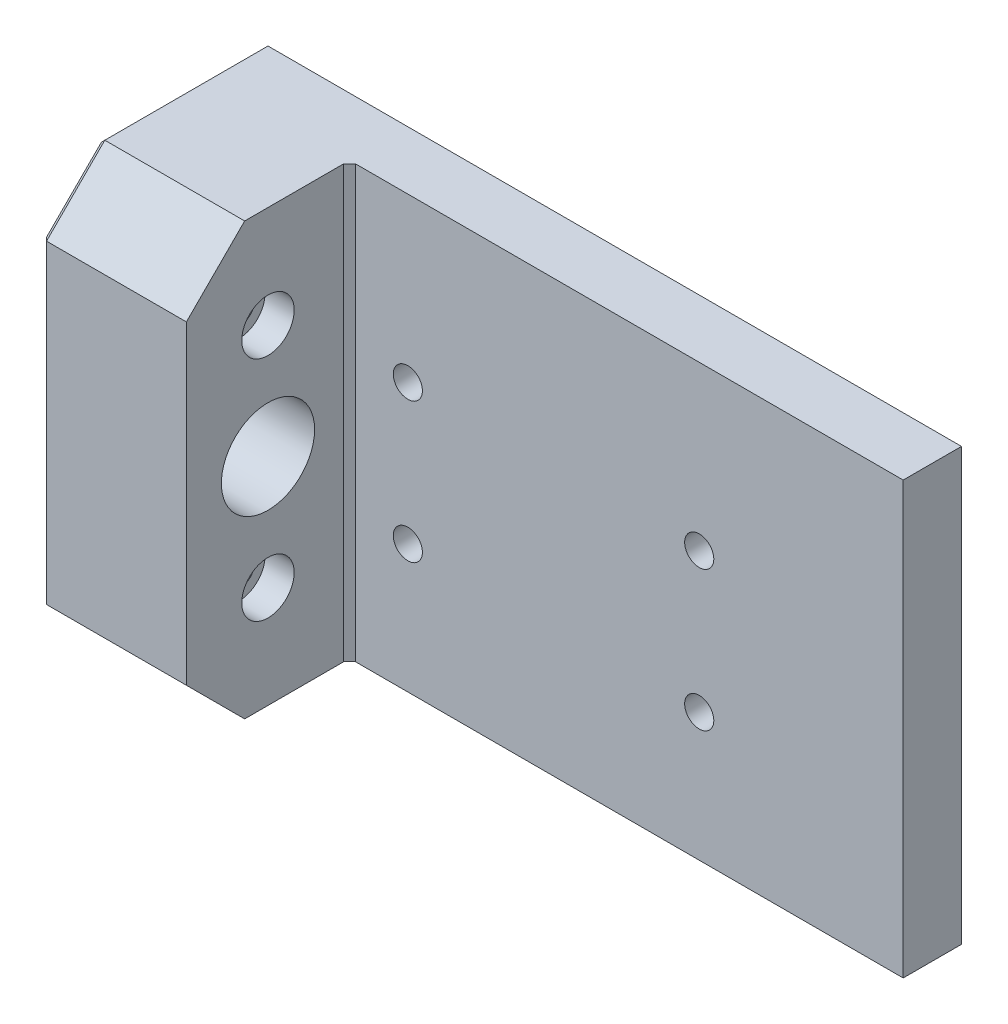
ISO-10303-21;
HEADER;
FILE_DESCRIPTION(('STEP AP214'),'2;1');
FILE_NAME('part.step','',(''),(''),'','','');
FILE_SCHEMA(('AUTOMOTIVE_DESIGN { 1 0 10303 214 1 1 1 1 }'));
ENDSEC;
DATA;
#1=APPLICATION_CONTEXT('core data for automotive mechanical design processes');
#2=APPLICATION_PROTOCOL_DEFINITION('international standard','automotive_design',2000,#1);
#3=PRODUCT_CONTEXT('',#1,'mechanical');
#4=PRODUCT('Part','Part','',(#3));
#5=PRODUCT_RELATED_PRODUCT_CATEGORY('part','',(#4));
#6=PRODUCT_DEFINITION_FORMATION('','',#4);
#7=PRODUCT_DEFINITION_CONTEXT('part definition',#1,'design');
#8=PRODUCT_DEFINITION('design','',#6,#7);
#9=PRODUCT_DEFINITION_SHAPE('','',#8);
#10=(LENGTH_UNIT() NAMED_UNIT(*) SI_UNIT(.MILLI.,.METRE.));
#11=(NAMED_UNIT(*) PLANE_ANGLE_UNIT() SI_UNIT($,.RADIAN.));
#12=(NAMED_UNIT(*) SI_UNIT($,.STERADIAN.) SOLID_ANGLE_UNIT());
#13=UNCERTAINTY_MEASURE_WITH_UNIT(LENGTH_MEASURE(1.E-05),#10,'distance_accuracy_value','');
#14=(GEOMETRIC_REPRESENTATION_CONTEXT(3) GLOBAL_UNCERTAINTY_ASSIGNED_CONTEXT((#13)) GLOBAL_UNIT_ASSIGNED_CONTEXT((#10,
#11,#12)) REPRESENTATION_CONTEXT('',''));
#15=CARTESIAN_POINT('',(0.,0.,0.));
#16=DIRECTION('',(0.,0.,1.));
#17=DIRECTION('',(1.,0.,0.));
#18=AXIS2_PLACEMENT_3D('',#15,#16,#17);
#19=CARTESIAN_POINT('',(60.0000000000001,17.5,4.99999999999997));
#20=DIRECTION('',(-1.,0.,0.));
#21=DIRECTION('',(0.,0.,1.));
#22=AXIS2_PLACEMENT_3D('',#19,#20,#21);
#23=CYLINDRICAL_SURFACE('',#22,2.75);
#24=CARTESIAN_POINT('',(-50.,17.5,5.00000000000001));
#25=DIRECTION('',(-1.,0.,0.));
#26=DIRECTION('',(0.,0.,1.));
#27=AXIS2_PLACEMENT_3D('',#24,#25,#26);
#28=CIRCLE('',#27,2.75);
#29=CARTESIAN_POINT('',(-50.,17.5,7.75000000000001));
#30=VERTEX_POINT('',#29);
#31=EDGE_CURVE('E20',#30,#30,#28,.F.);
#32=ORIENTED_EDGE('',*,*,#31,.F.);
#33=EDGE_LOOP('',(#32));
#34=FACE_BOUND('',#33,.T.);
#35=CARTESIAN_POINT('',(-39.9999999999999,17.5,5.00000000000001));
#36=DIRECTION('',(-1.,0.,0.));
#37=DIRECTION('',(0.,0.,1.));
#38=AXIS2_PLACEMENT_3D('',#35,#36,#37);
#39=CIRCLE('',#38,2.75);
#40=CARTESIAN_POINT('',(-39.9999999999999,17.5,7.75000000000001));
#41=VERTEX_POINT('',#40);
#42=EDGE_CURVE('E212',#41,#41,#39,.T.);
#43=ORIENTED_EDGE('',*,*,#42,.F.);
#44=EDGE_LOOP('',(#43));
#45=FACE_BOUND('',#44,.T.);
#46=ADVANCED_FACE('F17',(#34,#45),#23,.F.);
#47=CARTESIAN_POINT('',(60.0000000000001,56.5,4.99999999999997));
#48=DIRECTION('',(-1.,0.,0.));
#49=DIRECTION('',(0.,0.,1.));
#50=AXIS2_PLACEMENT_3D('',#47,#48,#49);
#51=CYLINDRICAL_SURFACE('',#50,2.75);
#52=CARTESIAN_POINT('',(-50.,56.5,5.00000000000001));
#53=DIRECTION('',(-1.,0.,0.));
#54=DIRECTION('',(0.,0.,1.));
#55=AXIS2_PLACEMENT_3D('',#52,#53,#54);
#56=CIRCLE('',#55,2.75);
#57=CARTESIAN_POINT('',(-50.,56.5,7.75000000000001));
#58=VERTEX_POINT('',#57);
#59=EDGE_CURVE('E214',#58,#58,#56,.F.);
#60=ORIENTED_EDGE('',*,*,#59,.F.);
#61=EDGE_LOOP('',(#60));
#62=FACE_BOUND('',#61,.T.);
#63=CARTESIAN_POINT('',(-39.9999999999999,56.5,5.00000000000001));
#64=DIRECTION('',(-1.,0.,0.));
#65=DIRECTION('',(0.,0.,1.));
#66=AXIS2_PLACEMENT_3D('',#63,#64,#65);
#67=CIRCLE('',#66,2.75);
#68=CARTESIAN_POINT('',(-39.9999999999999,56.5,7.75000000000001));
#69=VERTEX_POINT('',#68);
#70=EDGE_CURVE('E117',#69,#69,#67,.T.);
#71=ORIENTED_EDGE('',*,*,#70,.F.);
#72=EDGE_LOOP('',(#71));
#73=FACE_BOUND('',#72,.T.);
#74=ADVANCED_FACE('F225',(#62,#73),#51,.F.);
#75=CARTESIAN_POINT('',(-50.,17.5,5.00000000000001));
#76=DIRECTION('',(-1.,0.,0.));
#77=DIRECTION('',(0.,0.,1.));
#78=AXIS2_PLACEMENT_3D('',#75,#76,#77);
#79=PLANE('',#78);
#80=CARTESIAN_POINT('',(-50.,17.5,5.00000000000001));
#81=DIRECTION('',(-1.,0.,0.));
#82=DIRECTION('',(0.,0.,1.));
#83=AXIS2_PLACEMENT_3D('',#80,#81,#82);
#84=CIRCLE('',#83,6.);
#85=CARTESIAN_POINT('',(-50.,17.5,11.));
#86=VERTEX_POINT('',#85);
#87=EDGE_CURVE('E116',#86,#86,#84,.T.);
#88=ORIENTED_EDGE('',*,*,#87,.T.);
#89=EDGE_LOOP('',(#88));
#90=FACE_BOUND('',#89,.T.);
#91=ORIENTED_EDGE('',*,*,#31,.T.);
#92=EDGE_LOOP('',(#91));
#93=FACE_BOUND('',#92,.T.);
#94=ADVANCED_FACE('F221',(#90,#93),#79,.T.);
#95=CARTESIAN_POINT('',(-50.,56.5,5.00000000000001));
#96=DIRECTION('',(-1.,0.,0.));
#97=DIRECTION('',(0.,0.,1.));
#98=AXIS2_PLACEMENT_3D('',#95,#96,#97);
#99=PLANE('',#98);
#100=CARTESIAN_POINT('',(-50.,56.5,5.00000000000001));
#101=DIRECTION('',(-1.,0.,0.));
#102=DIRECTION('',(0.,0.,1.));
#103=AXIS2_PLACEMENT_3D('',#100,#101,#102);
#104=CIRCLE('',#103,6.);
#105=CARTESIAN_POINT('',(-50.,56.5,11.));
#106=VERTEX_POINT('',#105);
#107=EDGE_CURVE('E205',#106,#106,#104,.T.);
#108=ORIENTED_EDGE('',*,*,#107,.T.);
#109=EDGE_LOOP('',(#108));
#110=FACE_BOUND('',#109,.T.);
#111=ORIENTED_EDGE('',*,*,#59,.T.);
#112=EDGE_LOOP('',(#111));
#113=FACE_BOUND('',#112,.T.);
#114=ADVANCED_FACE('F232',(#110,#113),#99,.T.);
#115=CARTESIAN_POINT('',(-40.,17.5,5.00000000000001));
#116=DIRECTION('',(1.,0.,0.));
#117=DIRECTION('',(0.,0.,-1.));
#118=AXIS2_PLACEMENT_3D('',#115,#116,#117);
#119=PLANE('',#118);
#120=ORIENTED_EDGE('',*,*,#42,.T.);
#121=EDGE_LOOP('',(#120));
#122=FACE_BOUND('',#121,.T.);
#123=CARTESIAN_POINT('',(-40.,17.5,5.00000000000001));
#124=DIRECTION('',(1.,0.,0.));
#125=DIRECTION('',(0.,0.,-1.));
#126=AXIS2_PLACEMENT_3D('',#123,#124,#125);
#127=CIRCLE('',#126,4.5);
#128=CARTESIAN_POINT('',(-40.,17.5,0.500000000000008));
#129=VERTEX_POINT('',#128);
#130=EDGE_CURVE('E202',#129,#129,#127,.T.);
#131=ORIENTED_EDGE('',*,*,#130,.T.);
#132=EDGE_LOOP('',(#131));
#133=FACE_BOUND('',#132,.T.);
#134=ADVANCED_FACE('F228',(#122,#133),#119,.T.);
#135=CARTESIAN_POINT('',(-40.,56.5,5.00000000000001));
#136=DIRECTION('',(1.,0.,0.));
#137=DIRECTION('',(0.,0.,-1.));
#138=AXIS2_PLACEMENT_3D('',#135,#136,#137);
#139=PLANE('',#138);
#140=ORIENTED_EDGE('',*,*,#70,.T.);
#141=EDGE_LOOP('',(#140));
#142=FACE_BOUND('',#141,.T.);
#143=CARTESIAN_POINT('',(-40.,56.5,5.00000000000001));
#144=DIRECTION('',(1.,0.,0.));
#145=DIRECTION('',(0.,0.,-1.));
#146=AXIS2_PLACEMENT_3D('',#143,#144,#145);
#147=CIRCLE('',#146,4.5);
#148=CARTESIAN_POINT('',(-40.,56.5,0.50000000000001));
#149=VERTEX_POINT('',#148);
#150=EDGE_CURVE('E151',#149,#149,#147,.T.);
#151=ORIENTED_EDGE('',*,*,#150,.T.);
#152=EDGE_LOOP('',(#151));
#153=FACE_BOUND('',#152,.T.);
#154=ADVANCED_FACE('F231',(#142,#153),#139,.T.);
#155=CARTESIAN_POINT('',(-60.,87.2928932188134,-5.70710678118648));
#156=DIRECTION('',(-0.707106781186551,0.499999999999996,0.499999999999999));
#157=DIRECTION('',(0.577350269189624,0.,0.816496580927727));
#158=AXIS2_PLACEMENT_3D('',#155,#156,#157);
#159=PLANE('',#158);
#160=DIRECTION('',(0.678598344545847,0.281084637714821,0.678598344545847));
#161=VECTOR('',#160,1.);
#162=CARTESIAN_POINT('',(-60.,63.5857864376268,18.));
#163=LINE('',#162,#161);
#164=CARTESIAN_POINT('',(-60.,63.5857864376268,18.));
#165=VERTEX_POINT('',#164);
#166=CARTESIAN_POINT('',(-58.9999999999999,63.9999999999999,19.));
#167=VERTEX_POINT('',#166);
#168=EDGE_CURVE('E106',#165,#167,#163,.T.);
#169=ORIENTED_EDGE('',*,*,#168,.T.);
#170=DIRECTION('',(0.,-0.707106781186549,0.707106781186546));
#171=VECTOR('',#170,1.);
#172=CARTESIAN_POINT('',(-58.9999999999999,74.,9.00000000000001));
#173=LINE('',#172,#171);
#174=CARTESIAN_POINT('',(-58.9999999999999,74.,9.00000000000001));
#175=VERTEX_POINT('',#174);
#176=EDGE_CURVE('E109',#175,#167,#173,.T.);
#177=ORIENTED_EDGE('',*,*,#176,.F.);
#178=DIRECTION('',(0.678598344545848,0.678598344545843,0.281084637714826));
#179=VECTOR('',#178,1.);
#180=CARTESIAN_POINT('',(-60.,73.,8.5857864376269));
#181=LINE('',#180,#179);
#182=CARTESIAN_POINT('',(-60.,73.,8.5857864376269));
#183=VERTEX_POINT('',#182);
#184=EDGE_CURVE('E103',#183,#175,#181,.T.);
#185=ORIENTED_EDGE('',*,*,#184,.F.);
#186=DIRECTION('',(0.,-0.707106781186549,0.707106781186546));
#187=VECTOR('',#186,1.);
#188=CARTESIAN_POINT('',(-60.,73.,8.5857864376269));
#189=LINE('',#188,#187);
#190=EDGE_CURVE('E111',#183,#165,#189,.T.);
#191=ORIENTED_EDGE('',*,*,#190,.T.);
#192=EDGE_LOOP('',(#169,#177,#185,#191));
#193=FACE_BOUND('',#192,.T.);
#194=ADVANCED_FACE('F108',(#193),#159,.T.);
#195=CARTESIAN_POINT('',(-58.9999999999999,74.,19.));
#196=DIRECTION('',(0.707106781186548,0.,-0.707106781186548));
#197=DIRECTION('',(-0.707106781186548,0.,-0.707106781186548));
#198=AXIS2_PLACEMENT_3D('',#195,#196,#197);
#199=PLANE('',#198);
#200=DIRECTION('',(0.,1.,0.));
#201=VECTOR('',#200,1.);
#202=CARTESIAN_POINT('',(-60.,74.,18.));
#203=LINE('',#202,#201);
#204=CARTESIAN_POINT('',(-60.,10.4142135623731,18.));
#205=VERTEX_POINT('',#204);
#206=EDGE_CURVE('E368',#165,#205,#203,.F.);
#207=ORIENTED_EDGE('',*,*,#206,.T.);
#208=DIRECTION('',(0.678598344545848,-0.281084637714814,0.678598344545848));
#209=VECTOR('',#208,1.);
#210=CARTESIAN_POINT('',(-60.,10.4142135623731,18.));
#211=LINE('',#210,#209);
#212=CARTESIAN_POINT('',(-58.9999999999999,9.99999999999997,19.));
#213=VERTEX_POINT('',#212);
#214=EDGE_CURVE('E131',#205,#213,#211,.T.);
#215=ORIENTED_EDGE('',*,*,#214,.T.);
#216=DIRECTION('',(0.,1.,0.));
#217=VECTOR('',#216,1.);
#218=CARTESIAN_POINT('',(-58.9999999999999,74.,19.));
#219=LINE('',#218,#217);
#220=EDGE_CURVE('E129',#213,#167,#219,.T.);
#221=ORIENTED_EDGE('',*,*,#220,.T.);
#222=ORIENTED_EDGE('',*,*,#168,.F.);
#223=EDGE_LOOP('',(#207,#215,#221,#222));
#224=FACE_BOUND('',#223,.T.);
#225=ADVANCED_FACE('F130',(#224),#199,.F.);
#226=CARTESIAN_POINT('',(-50.,17.5,5.00000000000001));
#227=DIRECTION('',(-1.,0.,0.));
#228=DIRECTION('',(0.,0.,1.));
#229=AXIS2_PLACEMENT_3D('',#226,#227,#228);
#230=CYLINDRICAL_SURFACE('',#229,6.);
#231=ORIENTED_EDGE('',*,*,#87,.F.);
#232=EDGE_LOOP('',(#231));
#233=FACE_BOUND('',#232,.T.);
#234=CARTESIAN_POINT('',(-60.,17.5,5.00000000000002));
#235=DIRECTION('',(-1.,0.,0.));
#236=DIRECTION('',(0.,0.,1.));
#237=AXIS2_PLACEMENT_3D('',#234,#235,#236);
#238=CIRCLE('',#237,6.);
#239=CARTESIAN_POINT('',(-60.,17.5,11.));
#240=VERTEX_POINT('',#239);
#241=EDGE_CURVE('E196',#240,#240,#238,.T.);
#242=ORIENTED_EDGE('',*,*,#241,.T.);
#243=EDGE_LOOP('',(#242));
#244=FACE_BOUND('',#243,.T.);
#245=ADVANCED_FACE('F412',(#233,#244),#230,.F.);
#246=CARTESIAN_POINT('',(-50.,56.5,5.00000000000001));
#247=DIRECTION('',(-1.,0.,0.));
#248=DIRECTION('',(0.,0.,1.));
#249=AXIS2_PLACEMENT_3D('',#246,#247,#248);
#250=CYLINDRICAL_SURFACE('',#249,6.);
#251=ORIENTED_EDGE('',*,*,#107,.F.);
#252=EDGE_LOOP('',(#251));
#253=FACE_BOUND('',#252,.T.);
#254=CARTESIAN_POINT('',(-60.,56.5,5.00000000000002));
#255=DIRECTION('',(-1.,0.,0.));
#256=DIRECTION('',(0.,0.,1.));
#257=AXIS2_PLACEMENT_3D('',#254,#255,#256);
#258=CIRCLE('',#257,6.);
#259=CARTESIAN_POINT('',(-60.,56.5,11.));
#260=VERTEX_POINT('',#259);
#261=EDGE_CURVE('E193',#260,#260,#258,.T.);
#262=ORIENTED_EDGE('',*,*,#261,.T.);
#263=EDGE_LOOP('',(#262));
#264=FACE_BOUND('',#263,.T.);
#265=ADVANCED_FACE('F240',(#253,#264),#250,.F.);
#266=CARTESIAN_POINT('',(-40.,17.5,5.00000000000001));
#267=DIRECTION('',(1.,0.,0.));
#268=DIRECTION('',(0.,0.,-1.));
#269=AXIS2_PLACEMENT_3D('',#266,#267,#268);
#270=CYLINDRICAL_SURFACE('',#269,4.5);
#271=ORIENTED_EDGE('',*,*,#130,.F.);
#272=EDGE_LOOP('',(#271));
#273=FACE_BOUND('',#272,.T.);
#274=CARTESIAN_POINT('',(-35.,17.5,5.00000000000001));
#275=DIRECTION('',(1.,0.,0.));
#276=DIRECTION('',(0.,0.,-1.));
#277=AXIS2_PLACEMENT_3D('',#274,#275,#276);
#278=CIRCLE('',#277,4.5);
#279=CARTESIAN_POINT('',(-35.,17.5,0.500000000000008));
#280=VERTEX_POINT('',#279);
#281=EDGE_CURVE('E187',#280,#280,#278,.T.);
#282=ORIENTED_EDGE('',*,*,#281,.T.);
#283=EDGE_LOOP('',(#282));
#284=FACE_BOUND('',#283,.T.);
#285=ADVANCED_FACE('F236',(#273,#284),#270,.F.);
#286=CARTESIAN_POINT('',(-40.,56.5,5.00000000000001));
#287=DIRECTION('',(1.,0.,0.));
#288=DIRECTION('',(0.,0.,-1.));
#289=AXIS2_PLACEMENT_3D('',#286,#287,#288);
#290=CYLINDRICAL_SURFACE('',#289,4.5);
#291=ORIENTED_EDGE('',*,*,#150,.F.);
#292=EDGE_LOOP('',(#291));
#293=FACE_BOUND('',#292,.T.);
#294=CARTESIAN_POINT('',(-35.,56.5,5.00000000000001));
#295=DIRECTION('',(1.,0.,0.));
#296=DIRECTION('',(0.,0.,-1.));
#297=AXIS2_PLACEMENT_3D('',#294,#295,#296);
#298=CIRCLE('',#297,4.5);
#299=CARTESIAN_POINT('',(-35.,56.5,0.50000000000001));
#300=VERTEX_POINT('',#299);
#301=EDGE_CURVE('E184',#300,#300,#298,.T.);
#302=ORIENTED_EDGE('',*,*,#301,.T.);
#303=EDGE_LOOP('',(#302));
#304=FACE_BOUND('',#303,.T.);
#305=ADVANCED_FACE('F239',(#293,#304),#290,.F.);
#306=CARTESIAN_POINT('',(-60.,37.,5.00000000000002));
#307=DIRECTION('',(1.,0.,0.));
#308=DIRECTION('',(0.,0.,-1.));
#309=AXIS2_PLACEMENT_3D('',#306,#307,#308);
#310=CYLINDRICAL_SURFACE('',#309,8.);
#311=CARTESIAN_POINT('',(-60.,37.,5.00000000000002));
#312=DIRECTION('',(1.,0.,0.));
#313=DIRECTION('',(0.,0.,-1.));
#314=AXIS2_PLACEMENT_3D('',#311,#312,#313);
#315=CIRCLE('',#314,8.);
#316=CARTESIAN_POINT('',(-60.,37.,-2.99999999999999));
#317=VERTEX_POINT('',#316);
#318=EDGE_CURVE('E190',#317,#317,#315,.F.);
#319=ORIENTED_EDGE('',*,*,#318,.T.);
#320=EDGE_LOOP('',(#319));
#321=FACE_BOUND('',#320,.T.);
#322=CARTESIAN_POINT('',(-35.,37.,5.00000000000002));
#323=DIRECTION('',(1.,0.,0.));
#324=DIRECTION('',(0.,0.,-1.));
#325=AXIS2_PLACEMENT_3D('',#322,#323,#324);
#326=CIRCLE('',#325,8.);
#327=CARTESIAN_POINT('',(-35.,37.,-2.99999999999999));
#328=VERTEX_POINT('',#327);
#329=EDGE_CURVE('E181',#328,#328,#326,.T.);
#330=ORIENTED_EDGE('',*,*,#329,.T.);
#331=EDGE_LOOP('',(#330));
#332=FACE_BOUND('',#331,.T.);
#333=ADVANCED_FACE('F396',(#321,#332),#310,.F.);
#334=CARTESIAN_POINT('',(-35.,0.,-7.99999999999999));
#335=DIRECTION('',(0.707106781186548,0.,0.707106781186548));
#336=DIRECTION('',(0.707106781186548,0.,-0.707106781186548));
#337=AXIS2_PLACEMENT_3D('',#334,#335,#336);
#338=PLANE('',#337);
#339=DIRECTION('',(0.707106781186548,0.,-0.707106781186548));
#340=VECTOR('',#339,1.);
#341=CARTESIAN_POINT('',(-35.,74.,-7.99999999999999));
#342=LINE('',#341,#340);
#343=CARTESIAN_POINT('',(-34.,74.,-8.99999999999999));
#344=VERTEX_POINT('',#343);
#345=CARTESIAN_POINT('',(-35.,74.,-7.99999999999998));
#346=VERTEX_POINT('',#345);
#347=EDGE_CURVE('E148',#344,#346,#342,.F.);
#348=ORIENTED_EDGE('',*,*,#347,.T.);
#349=DIRECTION('',(0.,1.,0.));
#350=VECTOR('',#349,1.);
#351=CARTESIAN_POINT('',(-35.,0.,-7.99999999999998));
#352=LINE('',#351,#350);
#353=CARTESIAN_POINT('',(-35.,0.,-7.99999999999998));
#354=VERTEX_POINT('',#353);
#355=EDGE_CURVE('E361',#346,#354,#352,.F.);
#356=ORIENTED_EDGE('',*,*,#355,.T.);
#357=DIRECTION('',(0.707106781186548,0.,-0.707106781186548));
#358=VECTOR('',#357,1.);
#359=CARTESIAN_POINT('',(-35.,0.,-7.99999999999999));
#360=LINE('',#359,#358);
#361=CARTESIAN_POINT('',(-34.,0.,-8.99999999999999));
#362=VERTEX_POINT('',#361);
#363=EDGE_CURVE('E150',#354,#362,#360,.T.);
#364=ORIENTED_EDGE('',*,*,#363,.T.);
#365=DIRECTION('',(0.,1.,0.));
#366=VECTOR('',#365,1.);
#367=CARTESIAN_POINT('',(-34.,0.,-8.99999999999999));
#368=LINE('',#367,#366);
#369=EDGE_CURVE('E358',#362,#344,#368,.T.);
#370=ORIENTED_EDGE('',*,*,#369,.T.);
#371=EDGE_LOOP('',(#348,#356,#364,#370));
#372=FACE_BOUND('',#371,.T.);
#373=ADVANCED_FACE('F394',(#372),#338,.T.);
#374=CARTESIAN_POINT('',(-60.,23.7071067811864,31.2928932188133));
#375=DIRECTION('',(0.707106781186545,0.500000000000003,-0.5));
#376=DIRECTION('',(-0.577350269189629,0.816496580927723,0.));
#377=AXIS2_PLACEMENT_3D('',#374,#375,#376);
#378=PLANE('',#377);
#379=DIRECTION('',(0.,0.707106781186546,0.707106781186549));
#380=VECTOR('',#379,1.);
#381=CARTESIAN_POINT('',(-58.9999999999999,9.99999999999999,19.));
#382=LINE('',#381,#380);
#383=CARTESIAN_POINT('',(-58.9999999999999,0.,8.99999999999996));
#384=VERTEX_POINT('',#383);
#385=EDGE_CURVE('E349',#384,#213,#382,.T.);
#386=ORIENTED_EDGE('',*,*,#385,.T.);
#387=ORIENTED_EDGE('',*,*,#214,.F.);
#388=DIRECTION('',(0.,-0.707106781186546,-0.70710678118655));
#389=VECTOR('',#388,1.);
#390=CARTESIAN_POINT('',(-60.,10.4142135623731,18.));
#391=LINE('',#390,#389);
#392=CARTESIAN_POINT('',(-60.,1.00000000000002,8.58578643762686));
#393=VERTEX_POINT('',#392);
#394=EDGE_CURVE('E199',#205,#393,#391,.T.);
#395=ORIENTED_EDGE('',*,*,#394,.T.);
#396=DIRECTION('',(0.67859834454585,-0.678598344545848,0.281084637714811));
#397=VECTOR('',#396,1.);
#398=CARTESIAN_POINT('',(-60.,1.00000000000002,8.58578643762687));
#399=LINE('',#398,#397);
#400=EDGE_CURVE('E312',#393,#384,#399,.T.);
#401=ORIENTED_EDGE('',*,*,#400,.T.);
#402=EDGE_LOOP('',(#386,#387,#395,#401));
#403=FACE_BOUND('',#402,.T.);
#404=ADVANCED_FACE('F373',(#403),#378,.F.);
#405=CARTESIAN_POINT('',(-60.,74.,19.));
#406=DIRECTION('',(0.,0.,-1.));
#407=DIRECTION('',(-1.,0.,0.));
#408=AXIS2_PLACEMENT_3D('',#405,#406,#407);
#409=PLANE('',#408);
#410=ORIENTED_EDGE('',*,*,#220,.F.);
#411=DIRECTION('',(1.,0.,0.));
#412=VECTOR('',#411,1.);
#413=CARTESIAN_POINT('',(-60.,9.99999999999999,19.));
#414=LINE('',#413,#412);
#415=CARTESIAN_POINT('',(-35.,10.,19.));
#416=VERTEX_POINT('',#415);
#417=EDGE_CURVE('E180',#213,#416,#414,.T.);
#418=ORIENTED_EDGE('',*,*,#417,.T.);
#419=DIRECTION('',(0.,1.,0.));
#420=VECTOR('',#419,1.);
#421=CARTESIAN_POINT('',(-35.,0.,19.));
#422=LINE('',#421,#420);
#423=CARTESIAN_POINT('',(-35.,63.9999999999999,19.));
#424=VERTEX_POINT('',#423);
#425=EDGE_CURVE('E138',#416,#424,#422,.T.);
#426=ORIENTED_EDGE('',*,*,#425,.T.);
#427=DIRECTION('',(1.,0.,0.));
#428=VECTOR('',#427,1.);
#429=CARTESIAN_POINT('',(0.,63.9999999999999,19.));
#430=LINE('',#429,#428);
#431=EDGE_CURVE('E123',#167,#424,#430,.T.);
#432=ORIENTED_EDGE('',*,*,#431,.F.);
#433=EDGE_LOOP('',(#410,#418,#426,#432));
#434=FACE_BOUND('',#433,.T.);
#435=ADVANCED_FACE('F137',(#434),#409,.F.);
#436=CARTESIAN_POINT('',(-59.,74.,0.));
#437=DIRECTION('',(-0.707106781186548,0.707106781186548,0.));
#438=DIRECTION('',(-0.707106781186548,-0.707106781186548,0.));
#439=AXIS2_PLACEMENT_3D('',#436,#437,#438);
#440=PLANE('',#439);
#441=DIRECTION('',(-0.577350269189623,-0.577350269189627,0.577350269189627));
#442=VECTOR('',#441,1.);
#443=CARTESIAN_POINT('',(-59.,74.,-19.));
#444=LINE('',#443,#442);
#445=CARTESIAN_POINT('',(-59.,74.,-19.));
#446=VERTEX_POINT('',#445);
#447=CARTESIAN_POINT('',(-60.,73.,-18.));
#448=VERTEX_POINT('',#447);
#449=EDGE_CURVE('E126',#446,#448,#444,.T.);
#450=ORIENTED_EDGE('',*,*,#449,.T.);
#451=DIRECTION('',(0.,0.,-1.));
#452=VECTOR('',#451,1.);
#453=CARTESIAN_POINT('',(-60.,73.,-19.));
#454=LINE('',#453,#452);
#455=EDGE_CURVE('E139',#448,#183,#454,.F.);
#456=ORIENTED_EDGE('',*,*,#455,.T.);
#457=ORIENTED_EDGE('',*,*,#184,.T.);
#458=DIRECTION('',(0.,0.,1.));
#459=VECTOR('',#458,1.);
#460=CARTESIAN_POINT('',(-59.,74.,0.));
#461=LINE('',#460,#459);
#462=EDGE_CURVE('E343',#446,#175,#461,.T.);
#463=ORIENTED_EDGE('',*,*,#462,.F.);
#464=EDGE_LOOP('',(#450,#456,#457,#463));
#465=FACE_BOUND('',#464,.T.);
#466=ADVANCED_FACE('F381',(#465),#440,.T.);
#467=CARTESIAN_POINT('',(0.,74.,9.00000000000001));
#468=DIRECTION('',(0.,0.707106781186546,0.707106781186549));
#469=DIRECTION('',(0.,-0.707106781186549,0.707106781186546));
#470=AXIS2_PLACEMENT_3D('',#467,#468,#469);
#471=PLANE('',#470);
#472=ORIENTED_EDGE('',*,*,#431,.T.);
#473=DIRECTION('',(0.,0.707106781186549,-0.707106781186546));
#474=VECTOR('',#473,1.);
#475=CARTESIAN_POINT('',(-35.,63.9999999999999,19.));
#476=LINE('',#475,#474);
#477=CARTESIAN_POINT('',(-35.,74.,9.00000000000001));
#478=VERTEX_POINT('',#477);
#479=EDGE_CURVE('E364',#424,#478,#476,.T.);
#480=ORIENTED_EDGE('',*,*,#479,.T.);
#481=DIRECTION('',(1.,0.,0.));
#482=VECTOR('',#481,1.);
#483=CARTESIAN_POINT('',(0.,74.,9.00000000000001));
#484=LINE('',#483,#482);
#485=EDGE_CURVE('E125',#175,#478,#484,.T.);
#486=ORIENTED_EDGE('',*,*,#485,.F.);
#487=ORIENTED_EDGE('',*,*,#176,.T.);
#488=EDGE_LOOP('',(#472,#480,#486,#487));
#489=FACE_BOUND('',#488,.T.);
#490=ADVANCED_FACE('F120',(#489),#471,.T.);
#491=CARTESIAN_POINT('',(-60.,74.,-19.));
#492=DIRECTION('',(1.,0.,0.));
#493=DIRECTION('',(0.,0.,-1.));
#494=AXIS2_PLACEMENT_3D('',#491,#492,#493);
#495=PLANE('',#494);
#496=ORIENTED_EDGE('',*,*,#318,.F.);
#497=EDGE_LOOP('',(#496));
#498=FACE_BOUND('',#497,.T.);
#499=ORIENTED_EDGE('',*,*,#261,.F.);
#500=EDGE_LOOP('',(#499));
#501=FACE_BOUND('',#500,.T.);
#502=ORIENTED_EDGE('',*,*,#241,.F.);
#503=EDGE_LOOP('',(#502));
#504=FACE_BOUND('',#503,.T.);
#505=ORIENTED_EDGE('',*,*,#394,.F.);
#506=ORIENTED_EDGE('',*,*,#206,.F.);
#507=ORIENTED_EDGE('',*,*,#190,.F.);
#508=ORIENTED_EDGE('',*,*,#455,.F.);
#509=DIRECTION('',(0.,1.,0.));
#510=VECTOR('',#509,1.);
#511=CARTESIAN_POINT('',(-60.,74.,-18.));
#512=LINE('',#511,#510);
#513=CARTESIAN_POINT('',(-60.,1.00000000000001,-18.));
#514=VERTEX_POINT('',#513);
#515=EDGE_CURVE('E332',#448,#514,#512,.F.);
#516=ORIENTED_EDGE('',*,*,#515,.T.);
#517=DIRECTION('',(0.,0.,1.));
#518=VECTOR('',#517,1.);
#519=CARTESIAN_POINT('',(-60.,1.00000000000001,-19.));
#520=LINE('',#519,#518);
#521=EDGE_CURVE('E356',#514,#393,#520,.T.);
#522=ORIENTED_EDGE('',*,*,#521,.T.);
#523=EDGE_LOOP('',(#505,#506,#507,#508,#516,#522));
#524=FACE_BOUND('',#523,.T.);
#525=ADVANCED_FACE('F247',(#498,#501,#504,#524),#495,.F.);
#526=CARTESIAN_POINT('',(-35.,0.,19.));
#527=DIRECTION('',(-1.,0.,0.));
#528=DIRECTION('',(0.,0.,1.));
#529=AXIS2_PLACEMENT_3D('',#526,#527,#528);
#530=PLANE('',#529);
#531=ORIENTED_EDGE('',*,*,#355,.F.);
#532=DIRECTION('',(0.,0.,1.));
#533=VECTOR('',#532,1.);
#534=CARTESIAN_POINT('',(-35.,74.,0.));
#535=LINE('',#534,#533);
#536=EDGE_CURVE('E339',#478,#346,#535,.F.);
#537=ORIENTED_EDGE('',*,*,#536,.F.);
#538=ORIENTED_EDGE('',*,*,#479,.F.);
#539=ORIENTED_EDGE('',*,*,#425,.F.);
#540=DIRECTION('',(0.,0.707106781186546,0.707106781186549));
#541=VECTOR('',#540,1.);
#542=CARTESIAN_POINT('',(-35.,9.99999999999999,19.));
#543=LINE('',#542,#541);
#544=CARTESIAN_POINT('',(-35.,0.,8.99999999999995));
#545=VERTEX_POINT('',#544);
#546=EDGE_CURVE('E352',#416,#545,#543,.F.);
#547=ORIENTED_EDGE('',*,*,#546,.T.);
#548=DIRECTION('',(0.,0.,1.));
#549=VECTOR('',#548,1.);
#550=CARTESIAN_POINT('',(-35.,0.,0.));
#551=LINE('',#550,#549);
#552=EDGE_CURVE('E328',#545,#354,#551,.F.);
#553=ORIENTED_EDGE('',*,*,#552,.T.);
#554=EDGE_LOOP('',(#531,#537,#538,#539,#547,#553));
#555=FACE_BOUND('',#554,.T.);
#556=ORIENTED_EDGE('',*,*,#329,.F.);
#557=EDGE_LOOP('',(#556));
#558=FACE_BOUND('',#557,.T.);
#559=ORIENTED_EDGE('',*,*,#301,.F.);
#560=EDGE_LOOP('',(#559));
#561=FACE_BOUND('',#560,.T.);
#562=ORIENTED_EDGE('',*,*,#281,.F.);
#563=EDGE_LOOP('',(#562));
#564=FACE_BOUND('',#563,.T.);
#565=ADVANCED_FACE('F244',(#555,#558,#561,#564),#530,.F.);
#566=CARTESIAN_POINT('',(60.,0.,-9.));
#567=DIRECTION('',(0.,0.,-1.));
#568=DIRECTION('',(-1.,0.,0.));
#569=AXIS2_PLACEMENT_3D('',#566,#567,#568);
#570=PLANE('',#569);
#571=CARTESIAN_POINT('',(25.,22.,-8.99999999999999));
#572=DIRECTION('',(0.,0.,1.));
#573=DIRECTION('',(1.,0.,0.));
#574=AXIS2_PLACEMENT_3D('',#571,#572,#573);
#575=CIRCLE('',#574,2.5);
#576=CARTESIAN_POINT('',(27.5,22.,-8.99999999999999));
#577=VERTEX_POINT('',#576);
#578=EDGE_CURVE('E167',#577,#577,#575,.F.);
#579=ORIENTED_EDGE('',*,*,#578,.T.);
#580=EDGE_LOOP('',(#579));
#581=FACE_BOUND('',#580,.T.);
#582=CARTESIAN_POINT('',(-25.,46.,-8.99999999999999));
#583=DIRECTION('',(0.,0.,1.));
#584=DIRECTION('',(1.,0.,0.));
#585=AXIS2_PLACEMENT_3D('',#582,#583,#584);
#586=CIRCLE('',#585,2.5);
#587=CARTESIAN_POINT('',(-22.5,46.,-8.99999999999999));
#588=VERTEX_POINT('',#587);
#589=EDGE_CURVE('E174',#588,#588,#586,.F.);
#590=ORIENTED_EDGE('',*,*,#589,.T.);
#591=EDGE_LOOP('',(#590));
#592=FACE_BOUND('',#591,.T.);
#593=ORIENTED_EDGE('',*,*,#369,.F.);
#594=DIRECTION('',(1.,0.,0.));
#595=VECTOR('',#594,1.);
#596=CARTESIAN_POINT('',(0.,0.,-8.99999999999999));
#597=LINE('',#596,#595);
#598=CARTESIAN_POINT('',(60.,0.,-8.99999999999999));
#599=VERTEX_POINT('',#598);
#600=EDGE_CURVE('E322',#362,#599,#597,.T.);
#601=ORIENTED_EDGE('',*,*,#600,.T.);
#602=DIRECTION('',(0.,1.,0.));
#603=VECTOR('',#602,1.);
#604=CARTESIAN_POINT('',(60.,74.,-9.));
#605=LINE('',#604,#603);
#606=CARTESIAN_POINT('',(60.,74.,-8.99999999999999));
#607=VERTEX_POINT('',#606);
#608=EDGE_CURVE('E170',#599,#607,#605,.T.);
#609=ORIENTED_EDGE('',*,*,#608,.T.);
#610=DIRECTION('',(1.,0.,0.));
#611=VECTOR('',#610,1.);
#612=CARTESIAN_POINT('',(0.,74.,-8.99999999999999));
#613=LINE('',#612,#611);
#614=EDGE_CURVE('E337',#344,#607,#613,.T.);
#615=ORIENTED_EDGE('',*,*,#614,.F.);
#616=EDGE_LOOP('',(#593,#601,#609,#615));
#617=FACE_BOUND('',#616,.T.);
#618=CARTESIAN_POINT('',(25.,46.,-8.99999999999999));
#619=DIRECTION('',(0.,0.,1.));
#620=DIRECTION('',(1.,0.,0.));
#621=AXIS2_PLACEMENT_3D('',#618,#619,#620);
#622=CIRCLE('',#621,2.5);
#623=CARTESIAN_POINT('',(27.5,46.,-8.99999999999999));
#624=VERTEX_POINT('',#623);
#625=EDGE_CURVE('E177',#624,#624,#622,.F.);
#626=ORIENTED_EDGE('',*,*,#625,.T.);
#627=EDGE_LOOP('',(#626));
#628=FACE_BOUND('',#627,.T.);
#629=CARTESIAN_POINT('',(-25.,22.,-8.99999999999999));
#630=DIRECTION('',(0.,0.,1.));
#631=DIRECTION('',(1.,0.,0.));
#632=AXIS2_PLACEMENT_3D('',#629,#630,#631);
#633=CIRCLE('',#632,2.5);
#634=CARTESIAN_POINT('',(-22.5,22.,-8.99999999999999));
#635=VERTEX_POINT('',#634);
#636=EDGE_CURVE('E171',#635,#635,#633,.F.);
#637=ORIENTED_EDGE('',*,*,#636,.T.);
#638=EDGE_LOOP('',(#637));
#639=FACE_BOUND('',#638,.T.);
#640=ADVANCED_FACE('F246',(#581,#592,#617,#628,#639),#570,.F.);
#641=CARTESIAN_POINT('',(-60.,1.00000000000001,-19.));
#642=DIRECTION('',(0.707106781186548,0.707106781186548,0.));
#643=DIRECTION('',(-0.707106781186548,0.707106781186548,0.));
#644=AXIS2_PLACEMENT_3D('',#641,#642,#643);
#645=PLANE('',#644);
#646=DIRECTION('',(0.,0.,1.));
#647=VECTOR('',#646,1.);
#648=CARTESIAN_POINT('',(-59.,0.,0.));
#649=LINE('',#648,#647);
#650=CARTESIAN_POINT('',(-59.,0.,-19.));
#651=VERTEX_POINT('',#650);
#652=EDGE_CURVE('E34',#651,#384,#649,.T.);
#653=ORIENTED_EDGE('',*,*,#652,.T.);
#654=ORIENTED_EDGE('',*,*,#400,.F.);
#655=ORIENTED_EDGE('',*,*,#521,.F.);
#656=DIRECTION('',(0.577350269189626,-0.577350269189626,-0.577350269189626));
#657=VECTOR('',#656,1.);
#658=CARTESIAN_POINT('',(-60.,0.999999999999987,-18.));
#659=LINE('',#658,#657);
#660=EDGE_CURVE('E315',#514,#651,#659,.T.);
#661=ORIENTED_EDGE('',*,*,#660,.T.);
#662=EDGE_LOOP('',(#653,#654,#655,#661));
#663=FACE_BOUND('',#662,.T.);
#664=ADVANCED_FACE('F255',(#663),#645,.F.);
#665=CARTESIAN_POINT('',(-60.,9.99999999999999,19.));
#666=DIRECTION('',(0.,0.707106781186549,-0.707106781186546));
#667=DIRECTION('',(0.,0.707106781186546,0.707106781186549));
#668=AXIS2_PLACEMENT_3D('',#665,#666,#667);
#669=PLANE('',#668);
#670=ORIENTED_EDGE('',*,*,#385,.F.);
#671=DIRECTION('',(1.,0.,0.));
#672=VECTOR('',#671,1.);
#673=CARTESIAN_POINT('',(0.,0.,8.99999999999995));
#674=LINE('',#673,#672);
#675=EDGE_CURVE('E166',#384,#545,#674,.T.);
#676=ORIENTED_EDGE('',*,*,#675,.T.);
#677=ORIENTED_EDGE('',*,*,#546,.F.);
#678=ORIENTED_EDGE('',*,*,#417,.F.);
#679=EDGE_LOOP('',(#670,#676,#677,#678));
#680=FACE_BOUND('',#679,.T.);
#681=ADVANCED_FACE('F301',(#680),#669,.F.);
#682=CARTESIAN_POINT('',(25.,46.,19.));
#683=DIRECTION('',(0.,0.,1.));
#684=DIRECTION('',(1.,0.,0.));
#685=AXIS2_PLACEMENT_3D('',#682,#683,#684);
#686=CYLINDRICAL_SURFACE('',#685,2.5);
#687=CARTESIAN_POINT('',(25.,46.,-19.));
#688=DIRECTION('',(0.,0.,1.));
#689=DIRECTION('',(1.,0.,0.));
#690=AXIS2_PLACEMENT_3D('',#687,#688,#689);
#691=CIRCLE('',#690,2.5);
#692=CARTESIAN_POINT('',(27.5,46.,-19.));
#693=VERTEX_POINT('',#692);
#694=EDGE_CURVE('E163',#693,#693,#691,.F.);
#695=ORIENTED_EDGE('',*,*,#694,.T.);
#696=EDGE_LOOP('',(#695));
#697=FACE_BOUND('',#696,.T.);
#698=ORIENTED_EDGE('',*,*,#625,.F.);
#699=EDGE_LOOP('',(#698));
#700=FACE_BOUND('',#699,.T.);
#701=ADVANCED_FACE('F297',(#697,#700),#686,.F.);
#702=CARTESIAN_POINT('',(-25.,46.,19.));
#703=DIRECTION('',(0.,0.,1.));
#704=DIRECTION('',(1.,0.,0.));
#705=AXIS2_PLACEMENT_3D('',#702,#703,#704);
#706=CYLINDRICAL_SURFACE('',#705,2.5);
#707=CARTESIAN_POINT('',(-25.,46.,-19.));
#708=DIRECTION('',(0.,0.,1.));
#709=DIRECTION('',(1.,0.,0.));
#710=AXIS2_PLACEMENT_3D('',#707,#708,#709);
#711=CIRCLE('',#710,2.5);
#712=CARTESIAN_POINT('',(-22.5,46.,-19.));
#713=VERTEX_POINT('',#712);
#714=EDGE_CURVE('E160',#713,#713,#711,.F.);
#715=ORIENTED_EDGE('',*,*,#714,.T.);
#716=EDGE_LOOP('',(#715));
#717=FACE_BOUND('',#716,.T.);
#718=ORIENTED_EDGE('',*,*,#589,.F.);
#719=EDGE_LOOP('',(#718));
#720=FACE_BOUND('',#719,.T.);
#721=ADVANCED_FACE('F293',(#717,#720),#706,.F.);
#722=CARTESIAN_POINT('',(-25.,22.,19.));
#723=DIRECTION('',(0.,0.,1.));
#724=DIRECTION('',(1.,0.,0.));
#725=AXIS2_PLACEMENT_3D('',#722,#723,#724);
#726=CYLINDRICAL_SURFACE('',#725,2.5);
#727=CARTESIAN_POINT('',(-25.,22.,-19.));
#728=DIRECTION('',(0.,0.,1.));
#729=DIRECTION('',(1.,0.,0.));
#730=AXIS2_PLACEMENT_3D('',#727,#728,#729);
#731=CIRCLE('',#730,2.5);
#732=CARTESIAN_POINT('',(-22.5,22.,-19.));
#733=VERTEX_POINT('',#732);
#734=EDGE_CURVE('E157',#733,#733,#731,.F.);
#735=ORIENTED_EDGE('',*,*,#734,.T.);
#736=EDGE_LOOP('',(#735));
#737=FACE_BOUND('',#736,.T.);
#738=ORIENTED_EDGE('',*,*,#636,.F.);
#739=EDGE_LOOP('',(#738));
#740=FACE_BOUND('',#739,.T.);
#741=ADVANCED_FACE('F289',(#737,#740),#726,.F.);
#742=CARTESIAN_POINT('',(25.,22.,19.));
#743=DIRECTION('',(0.,0.,1.));
#744=DIRECTION('',(1.,0.,0.));
#745=AXIS2_PLACEMENT_3D('',#742,#743,#744);
#746=CYLINDRICAL_SURFACE('',#745,2.5);
#747=CARTESIAN_POINT('',(25.,22.,-19.));
#748=DIRECTION('',(0.,0.,1.));
#749=DIRECTION('',(1.,0.,0.));
#750=AXIS2_PLACEMENT_3D('',#747,#748,#749);
#751=CIRCLE('',#750,2.5);
#752=CARTESIAN_POINT('',(27.5,22.,-19.));
#753=VERTEX_POINT('',#752);
#754=EDGE_CURVE('E153',#753,#753,#751,.F.);
#755=ORIENTED_EDGE('',*,*,#754,.T.);
#756=EDGE_LOOP('',(#755));
#757=FACE_BOUND('',#756,.T.);
#758=ORIENTED_EDGE('',*,*,#578,.F.);
#759=EDGE_LOOP('',(#758));
#760=FACE_BOUND('',#759,.T.);
#761=ADVANCED_FACE('F285',(#757,#760),#746,.F.);
#762=CARTESIAN_POINT('',(60.,74.,-19.));
#763=DIRECTION('',(-1.,0.,0.));
#764=DIRECTION('',(0.,0.,1.));
#765=AXIS2_PLACEMENT_3D('',#762,#763,#764);
#766=PLANE('',#765);
#767=ORIENTED_EDGE('',*,*,#608,.F.);
#768=DIRECTION('',(0.,0.,1.));
#769=VECTOR('',#768,1.);
#770=CARTESIAN_POINT('',(60.,0.,0.));
#771=LINE('',#770,#769);
#772=CARTESIAN_POINT('',(60.,0.,-19.));
#773=VERTEX_POINT('',#772);
#774=EDGE_CURVE('E317',#599,#773,#771,.F.);
#775=ORIENTED_EDGE('',*,*,#774,.T.);
#776=DIRECTION('',(0.,1.,0.));
#777=VECTOR('',#776,1.);
#778=CARTESIAN_POINT('',(60.,74.,-19.));
#779=LINE('',#778,#777);
#780=CARTESIAN_POINT('',(60.,74.,-19.));
#781=VERTEX_POINT('',#780);
#782=EDGE_CURVE('E156',#773,#781,#779,.T.);
#783=ORIENTED_EDGE('',*,*,#782,.T.);
#784=DIRECTION('',(0.,0.,1.));
#785=VECTOR('',#784,1.);
#786=CARTESIAN_POINT('',(60.,74.,0.));
#787=LINE('',#786,#785);
#788=EDGE_CURVE('E335',#607,#781,#787,.F.);
#789=ORIENTED_EDGE('',*,*,#788,.F.);
#790=EDGE_LOOP('',(#767,#775,#783,#789));
#791=FACE_BOUND('',#790,.T.);
#792=ADVANCED_FACE('F281',(#791),#766,.F.);
#793=CARTESIAN_POINT('',(0.,74.,0.));
#794=DIRECTION('',(0.,1.,0.));
#795=DIRECTION('',(0.,0.,1.));
#796=AXIS2_PLACEMENT_3D('',#793,#794,#795);
#797=PLANE('',#796);
#798=ORIENTED_EDGE('',*,*,#614,.T.);
#799=ORIENTED_EDGE('',*,*,#788,.T.);
#800=DIRECTION('',(1.,0.,0.));
#801=VECTOR('',#800,1.);
#802=CARTESIAN_POINT('',(-60.,74.,-19.));
#803=LINE('',#802,#801);
#804=EDGE_CURVE('E379',#781,#446,#803,.F.);
#805=ORIENTED_EDGE('',*,*,#804,.T.);
#806=ORIENTED_EDGE('',*,*,#462,.T.);
#807=ORIENTED_EDGE('',*,*,#485,.T.);
#808=ORIENTED_EDGE('',*,*,#536,.T.);
#809=ORIENTED_EDGE('',*,*,#347,.F.);
#810=EDGE_LOOP('',(#798,#799,#805,#806,#807,#808,#809));
#811=FACE_BOUND('',#810,.T.);
#812=ADVANCED_FACE('F277',(#811),#797,.T.);
#813=CARTESIAN_POINT('',(-60.,74.,-18.));
#814=DIRECTION('',(0.707106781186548,0.,0.707106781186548));
#815=DIRECTION('',(0.707106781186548,0.,-0.707106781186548));
#816=AXIS2_PLACEMENT_3D('',#813,#814,#815);
#817=PLANE('',#816);
#818=DIRECTION('',(0.,1.,0.));
#819=VECTOR('',#818,1.);
#820=CARTESIAN_POINT('',(-59.,74.,-19.));
#821=LINE('',#820,#819);
#822=EDGE_CURVE('E26',#446,#651,#821,.F.);
#823=ORIENTED_EDGE('',*,*,#822,.T.);
#824=ORIENTED_EDGE('',*,*,#660,.F.);
#825=ORIENTED_EDGE('',*,*,#515,.F.);
#826=ORIENTED_EDGE('',*,*,#449,.F.);
#827=EDGE_LOOP('',(#823,#824,#825,#826));
#828=FACE_BOUND('',#827,.T.);
#829=ADVANCED_FACE('F270',(#828),#817,.F.);
#830=CARTESIAN_POINT('',(0.,0.,0.));
#831=DIRECTION('',(0.,1.,0.));
#832=DIRECTION('',(0.,0.,1.));
#833=AXIS2_PLACEMENT_3D('',#830,#831,#832);
#834=PLANE('',#833);
#835=ORIENTED_EDGE('',*,*,#652,.F.);
#836=DIRECTION('',(1.,0.,0.));
#837=VECTOR('',#836,1.);
#838=CARTESIAN_POINT('',(-60.,0.,-19.));
#839=LINE('',#838,#837);
#840=EDGE_CURVE('E11',#651,#773,#839,.T.);
#841=ORIENTED_EDGE('',*,*,#840,.T.);
#842=ORIENTED_EDGE('',*,*,#774,.F.);
#843=ORIENTED_EDGE('',*,*,#600,.F.);
#844=ORIENTED_EDGE('',*,*,#363,.F.);
#845=ORIENTED_EDGE('',*,*,#552,.F.);
#846=ORIENTED_EDGE('',*,*,#675,.F.);
#847=EDGE_LOOP('',(#835,#841,#842,#843,#844,#845,#846));
#848=FACE_BOUND('',#847,.T.);
#849=ADVANCED_FACE('F264',(#848),#834,.F.);
#850=CARTESIAN_POINT('',(-60.,74.,-19.));
#851=DIRECTION('',(0.,0.,1.));
#852=DIRECTION('',(1.,0.,0.));
#853=AXIS2_PLACEMENT_3D('',#850,#851,#852);
#854=PLANE('',#853);
#855=ORIENTED_EDGE('',*,*,#822,.F.);
#856=ORIENTED_EDGE('',*,*,#804,.F.);
#857=ORIENTED_EDGE('',*,*,#782,.F.);
#858=ORIENTED_EDGE('',*,*,#840,.F.);
#859=EDGE_LOOP('',(#855,#856,#857,#858));
#860=FACE_BOUND('',#859,.T.);
#861=ORIENTED_EDGE('',*,*,#754,.F.);
#862=EDGE_LOOP('',(#861));
#863=FACE_BOUND('',#862,.T.);
#864=ORIENTED_EDGE('',*,*,#734,.F.);
#865=EDGE_LOOP('',(#864));
#866=FACE_BOUND('',#865,.T.);
#867=ORIENTED_EDGE('',*,*,#714,.F.);
#868=EDGE_LOOP('',(#867));
#869=FACE_BOUND('',#868,.T.);
#870=ORIENTED_EDGE('',*,*,#694,.F.);
#871=EDGE_LOOP('',(#870));
#872=FACE_BOUND('',#871,.T.);
#873=ADVANCED_FACE('F262',(#860,#863,#866,#869,#872),#854,.F.);
#874=CLOSED_SHELL('',(#46,#74,#94,#114,#134,#154,#194,#225,#245,#265,#285,#305,#333,#373,#404,
#435,#466,#490,#525,#565,#640,#664,#681,#701,#721,#741,#761,#792,#812,#829,#849,#873));
#875=MANIFOLD_SOLID_BREP('B1',#874);
#876=ADVANCED_BREP_SHAPE_REPRESENTATION('',(#18,#875),#14);
#877=SHAPE_DEFINITION_REPRESENTATION(#9,#876);
ENDSEC;
END-ISO-10303-21;
